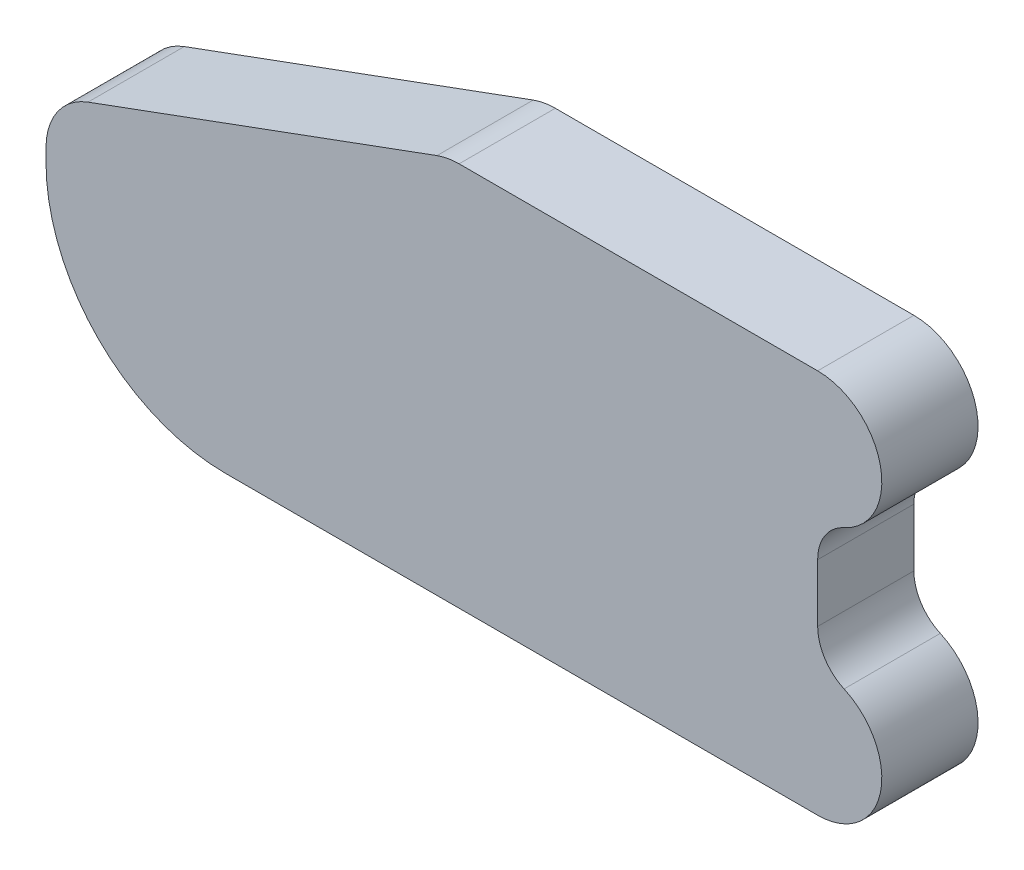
ISO-10303-21;
HEADER;
FILE_DESCRIPTION(('STEP AP214'),'2;1');
FILE_NAME('part.step','',(''),(''),'','','');
FILE_SCHEMA(('AUTOMOTIVE_DESIGN { 1 0 10303 214 1 1 1 1 }'));
ENDSEC;
DATA;
#1=APPLICATION_CONTEXT('core data for automotive mechanical design processes');
#2=APPLICATION_PROTOCOL_DEFINITION('international standard','automotive_design',2000,#1);
#3=PRODUCT_CONTEXT('',#1,'mechanical');
#4=PRODUCT('Part','Part','',(#3));
#5=PRODUCT_RELATED_PRODUCT_CATEGORY('part','',(#4));
#6=PRODUCT_DEFINITION_FORMATION('','',#4);
#7=PRODUCT_DEFINITION_CONTEXT('part definition',#1,'design');
#8=PRODUCT_DEFINITION('design','',#6,#7);
#9=PRODUCT_DEFINITION_SHAPE('','',#8);
#10=(LENGTH_UNIT() NAMED_UNIT(*) SI_UNIT(.MILLI.,.METRE.));
#11=(NAMED_UNIT(*) PLANE_ANGLE_UNIT() SI_UNIT($,.RADIAN.));
#12=(NAMED_UNIT(*) SI_UNIT($,.STERADIAN.) SOLID_ANGLE_UNIT());
#13=UNCERTAINTY_MEASURE_WITH_UNIT(LENGTH_MEASURE(1.E-05),#10,'distance_accuracy_value','');
#14=(GEOMETRIC_REPRESENTATION_CONTEXT(3) GLOBAL_UNCERTAINTY_ASSIGNED_CONTEXT((#13)) GLOBAL_UNIT_ASSIGNED_CONTEXT((#10,
#11,#12)) REPRESENTATION_CONTEXT('',''));
#15=CARTESIAN_POINT('',(0.,0.,0.));
#16=DIRECTION('',(0.,0.,1.));
#17=DIRECTION('',(1.,0.,0.));
#18=AXIS2_PLACEMENT_3D('',#15,#16,#17);
#19=CARTESIAN_POINT('',(-152.,28.,15.));
#20=DIRECTION('',(0.,0.,-1.));
#21=DIRECTION('',(-1.,0.,0.));
#22=AXIS2_PLACEMENT_3D('',#19,#20,#21);
#23=CYLINDRICAL_SURFACE('',#22,28.);
#24=CARTESIAN_POINT('',(-152.,28.,0.));
#25=DIRECTION('',(0.,0.,1.));
#26=DIRECTION('',(-1.,0.,0.));
#27=AXIS2_PLACEMENT_3D('',#24,#25,#26);
#28=CIRCLE('',#27,28.);
#29=CARTESIAN_POINT('',(-180.,28.,0.));
#30=VERTEX_POINT('',#29);
#31=CARTESIAN_POINT('',(-152.,0.,0.));
#32=VERTEX_POINT('',#31);
#33=EDGE_CURVE('E123',#30,#32,#28,.T.);
#34=ORIENTED_EDGE('',*,*,#33,.T.);
#35=DIRECTION('',(0.,0.,-1.));
#36=VECTOR('',#35,1.);
#37=CARTESIAN_POINT('',(-152.,0.,15.));
#38=LINE('',#37,#36);
#39=CARTESIAN_POINT('',(-152.,0.,15.));
#40=VERTEX_POINT('',#39);
#41=EDGE_CURVE('E11',#40,#32,#38,.T.);
#42=ORIENTED_EDGE('',*,*,#41,.F.);
#43=CARTESIAN_POINT('',(-152.,28.,15.));
#44=DIRECTION('',(0.,0.,1.));
#45=DIRECTION('',(-1.,0.,0.));
#46=AXIS2_PLACEMENT_3D('',#43,#44,#45);
#47=CIRCLE('',#46,28.);
#48=CARTESIAN_POINT('',(-180.,28.,15.));
#49=VERTEX_POINT('',#48);
#50=EDGE_CURVE('E158',#49,#40,#47,.T.);
#51=ORIENTED_EDGE('',*,*,#50,.F.);
#52=DIRECTION('',(0.,0.,-1.));
#53=VECTOR('',#52,1.);
#54=CARTESIAN_POINT('',(-180.,28.,15.));
#55=LINE('',#54,#53);
#56=EDGE_CURVE('E136',#49,#30,#55,.T.);
#57=ORIENTED_EDGE('',*,*,#56,.T.);
#58=EDGE_LOOP('',(#34,#42,#51,#57));
#59=FACE_BOUND('',#58,.T.);
#60=ADVANCED_FACE('F31',(#59),#23,.T.);
#61=CARTESIAN_POINT('',(-152.,0.,15.));
#62=DIRECTION('',(0.,1.,0.));
#63=DIRECTION('',(0.,0.,1.));
#64=AXIS2_PLACEMENT_3D('',#61,#62,#63);
#65=PLANE('',#64);
#66=DIRECTION('',(1.,0.,0.));
#67=VECTOR('',#66,1.);
#68=CARTESIAN_POINT('',(-152.,0.,0.));
#69=LINE('',#68,#67);
#70=CARTESIAN_POINT('',(-59.7,0.,0.));
#71=VERTEX_POINT('',#70);
#72=EDGE_CURVE('E119',#32,#71,#69,.T.);
#73=ORIENTED_EDGE('',*,*,#72,.T.);
#74=DIRECTION('',(0.,0.,-1.));
#75=VECTOR('',#74,1.);
#76=CARTESIAN_POINT('',(-59.7,0.,15.));
#77=LINE('',#76,#75);
#78=CARTESIAN_POINT('',(-59.7,0.,15.));
#79=VERTEX_POINT('',#78);
#80=EDGE_CURVE('E38',#79,#71,#77,.T.);
#81=ORIENTED_EDGE('',*,*,#80,.F.);
#82=DIRECTION('',(1.,0.,0.));
#83=VECTOR('',#82,1.);
#84=CARTESIAN_POINT('',(-152.,0.,15.));
#85=LINE('',#84,#83);
#86=EDGE_CURVE('E132',#40,#79,#85,.T.);
#87=ORIENTED_EDGE('',*,*,#86,.F.);
#88=ORIENTED_EDGE('',*,*,#41,.T.);
#89=EDGE_LOOP('',(#73,#81,#87,#88));
#90=FACE_BOUND('',#89,.T.);
#91=ADVANCED_FACE('F131',(#90),#65,.F.);
#92=CARTESIAN_POINT('',(-59.7,10.,15.));
#93=DIRECTION('',(0.,0.,-1.));
#94=DIRECTION('',(-1.,0.,0.));
#95=AXIS2_PLACEMENT_3D('',#92,#93,#94);
#96=CYLINDRICAL_SURFACE('',#95,10.);
#97=CARTESIAN_POINT('',(-59.7,10.,0.));
#98=DIRECTION('',(0.,0.,1.));
#99=DIRECTION('',(1.,0.,0.));
#100=AXIS2_PLACEMENT_3D('',#97,#98,#99);
#101=CIRCLE('',#100,10.);
#102=CARTESIAN_POINT('',(-55.5823529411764,19.1129019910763,0.));
#103=VERTEX_POINT('',#102);
#104=EDGE_CURVE('E125',#71,#103,#101,.T.);
#105=ORIENTED_EDGE('',*,*,#104,.T.);
#106=DIRECTION('',(0.,0.,-1.));
#107=VECTOR('',#106,1.);
#108=CARTESIAN_POINT('',(-55.5823529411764,19.1129019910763,15.));
#109=LINE('',#108,#107);
#110=CARTESIAN_POINT('',(-55.5823529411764,19.1129019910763,15.));
#111=VERTEX_POINT('',#110);
#112=EDGE_CURVE('E204',#111,#103,#109,.T.);
#113=ORIENTED_EDGE('',*,*,#112,.F.);
#114=CARTESIAN_POINT('',(-59.7,10.,15.));
#115=DIRECTION('',(0.,0.,1.));
#116=DIRECTION('',(1.,0.,0.));
#117=AXIS2_PLACEMENT_3D('',#114,#115,#116);
#118=CIRCLE('',#117,10.);
#119=EDGE_CURVE('E161',#79,#111,#118,.T.);
#120=ORIENTED_EDGE('',*,*,#119,.F.);
#121=ORIENTED_EDGE('',*,*,#80,.T.);
#122=EDGE_LOOP('',(#105,#113,#120,#121));
#123=FACE_BOUND('',#122,.T.);
#124=ADVANCED_FACE('F208',(#123),#96,.T.);
#125=CARTESIAN_POINT('',(-52.7,25.4919333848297,15.));
#126=DIRECTION('',(0.,0.,-1.));
#127=DIRECTION('',(-1.,0.,0.));
#128=AXIS2_PLACEMENT_3D('',#125,#126,#127);
#129=CYLINDRICAL_SURFACE('',#128,7.);
#130=CARTESIAN_POINT('',(-52.7,25.4919333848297,0.));
#131=DIRECTION('',(0.,0.,-1.));
#132=DIRECTION('',(-1.,0.,0.));
#133=AXIS2_PLACEMENT_3D('',#130,#131,#132);
#134=CIRCLE('',#133,7.);
#135=CARTESIAN_POINT('',(-59.7,25.4919333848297,0.));
#136=VERTEX_POINT('',#135);
#137=EDGE_CURVE('E140',#103,#136,#134,.T.);
#138=ORIENTED_EDGE('',*,*,#137,.T.);
#139=DIRECTION('',(0.,0.,-1.));
#140=VECTOR('',#139,1.);
#141=CARTESIAN_POINT('',(-59.7,25.4919333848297,15.));
#142=LINE('',#141,#140);
#143=CARTESIAN_POINT('',(-59.7,25.4919333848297,15.));
#144=VERTEX_POINT('',#143);
#145=EDGE_CURVE('E201',#144,#136,#142,.T.);
#146=ORIENTED_EDGE('',*,*,#145,.F.);
#147=CARTESIAN_POINT('',(-52.7,25.4919333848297,15.));
#148=DIRECTION('',(0.,0.,-1.));
#149=DIRECTION('',(-1.,0.,0.));
#150=AXIS2_PLACEMENT_3D('',#147,#148,#149);
#151=CIRCLE('',#150,7.);
#152=EDGE_CURVE('E163',#111,#144,#151,.T.);
#153=ORIENTED_EDGE('',*,*,#152,.F.);
#154=ORIENTED_EDGE('',*,*,#112,.T.);
#155=EDGE_LOOP('',(#138,#146,#153,#154));
#156=FACE_BOUND('',#155,.T.);
#157=ADVANCED_FACE('F216',(#156),#129,.F.);
#158=CARTESIAN_POINT('',(-59.7,34.5080666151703,15.));
#159=DIRECTION('',(-1.,0.,0.));
#160=DIRECTION('',(0.,0.,1.));
#161=AXIS2_PLACEMENT_3D('',#158,#159,#160);
#162=PLANE('',#161);
#163=DIRECTION('',(0.,1.,0.));
#164=VECTOR('',#163,1.);
#165=CARTESIAN_POINT('',(-59.7,34.5080666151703,0.));
#166=LINE('',#165,#164);
#167=CARTESIAN_POINT('',(-59.7,34.5080666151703,0.));
#168=VERTEX_POINT('',#167);
#169=EDGE_CURVE('E142',#136,#168,#166,.T.);
#170=ORIENTED_EDGE('',*,*,#169,.T.);
#171=DIRECTION('',(0.,0.,-1.));
#172=VECTOR('',#171,1.);
#173=CARTESIAN_POINT('',(-59.7,34.5080666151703,15.));
#174=LINE('',#173,#172);
#175=CARTESIAN_POINT('',(-59.7,34.5080666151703,15.));
#176=VERTEX_POINT('',#175);
#177=EDGE_CURVE('E198',#176,#168,#174,.T.);
#178=ORIENTED_EDGE('',*,*,#177,.F.);
#179=DIRECTION('',(0.,1.,0.));
#180=VECTOR('',#179,1.);
#181=CARTESIAN_POINT('',(-59.7,34.5080666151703,15.));
#182=LINE('',#181,#180);
#183=EDGE_CURVE('E165',#144,#176,#182,.T.);
#184=ORIENTED_EDGE('',*,*,#183,.F.);
#185=ORIENTED_EDGE('',*,*,#145,.T.);
#186=EDGE_LOOP('',(#170,#178,#184,#185));
#187=FACE_BOUND('',#186,.T.);
#188=ADVANCED_FACE('F219',(#187),#162,.F.);
#189=CARTESIAN_POINT('',(-52.7,34.5080666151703,15.));
#190=DIRECTION('',(0.,0.,-1.));
#191=DIRECTION('',(-1.,0.,0.));
#192=AXIS2_PLACEMENT_3D('',#189,#190,#191);
#193=CYLINDRICAL_SURFACE('',#192,7.);
#194=CARTESIAN_POINT('',(-52.7,34.5080666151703,0.));
#195=DIRECTION('',(0.,0.,-1.));
#196=DIRECTION('',(-1.,0.,0.));
#197=AXIS2_PLACEMENT_3D('',#194,#195,#196);
#198=CIRCLE('',#197,7.);
#199=CARTESIAN_POINT('',(-55.5823529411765,40.8870980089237,0.));
#200=VERTEX_POINT('',#199);
#201=EDGE_CURVE('E144',#168,#200,#198,.T.);
#202=ORIENTED_EDGE('',*,*,#201,.T.);
#203=DIRECTION('',(0.,0.,-1.));
#204=VECTOR('',#203,1.);
#205=CARTESIAN_POINT('',(-55.5823529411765,40.8870980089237,15.));
#206=LINE('',#205,#204);
#207=CARTESIAN_POINT('',(-55.5823529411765,40.8870980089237,15.));
#208=VERTEX_POINT('',#207);
#209=EDGE_CURVE('E195',#208,#200,#206,.T.);
#210=ORIENTED_EDGE('',*,*,#209,.F.);
#211=CARTESIAN_POINT('',(-52.7,34.5080666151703,15.));
#212=DIRECTION('',(0.,0.,-1.));
#213=DIRECTION('',(-1.,0.,0.));
#214=AXIS2_PLACEMENT_3D('',#211,#212,#213);
#215=CIRCLE('',#214,7.);
#216=EDGE_CURVE('E167',#176,#208,#215,.T.);
#217=ORIENTED_EDGE('',*,*,#216,.F.);
#218=ORIENTED_EDGE('',*,*,#177,.T.);
#219=EDGE_LOOP('',(#202,#210,#217,#218));
#220=FACE_BOUND('',#219,.T.);
#221=ADVANCED_FACE('F224',(#220),#193,.F.);
#222=CARTESIAN_POINT('',(-59.7,50.,15.));
#223=DIRECTION('',(0.,0.,-1.));
#224=DIRECTION('',(-1.,0.,0.));
#225=AXIS2_PLACEMENT_3D('',#222,#223,#224);
#226=CYLINDRICAL_SURFACE('',#225,10.);
#227=CARTESIAN_POINT('',(-59.7,50.,0.));
#228=DIRECTION('',(0.,0.,1.));
#229=DIRECTION('',(1.,0.,0.));
#230=AXIS2_PLACEMENT_3D('',#227,#228,#229);
#231=CIRCLE('',#230,10.);
#232=CARTESIAN_POINT('',(-59.7,60.,0.));
#233=VERTEX_POINT('',#232);
#234=EDGE_CURVE('E146',#200,#233,#231,.T.);
#235=ORIENTED_EDGE('',*,*,#234,.T.);
#236=DIRECTION('',(0.,0.,-1.));
#237=VECTOR('',#236,1.);
#238=CARTESIAN_POINT('',(-59.7,60.,15.));
#239=LINE('',#238,#237);
#240=CARTESIAN_POINT('',(-59.7,60.,15.));
#241=VERTEX_POINT('',#240);
#242=EDGE_CURVE('E192',#241,#233,#239,.T.);
#243=ORIENTED_EDGE('',*,*,#242,.F.);
#244=CARTESIAN_POINT('',(-59.7,50.,15.));
#245=DIRECTION('',(0.,0.,1.));
#246=DIRECTION('',(1.,0.,0.));
#247=AXIS2_PLACEMENT_3D('',#244,#245,#246);
#248=CIRCLE('',#247,10.);
#249=EDGE_CURVE('E169',#208,#241,#248,.T.);
#250=ORIENTED_EDGE('',*,*,#249,.F.);
#251=ORIENTED_EDGE('',*,*,#209,.T.);
#252=EDGE_LOOP('',(#235,#243,#250,#251));
#253=FACE_BOUND('',#252,.T.);
#254=ADVANCED_FACE('F230',(#253),#226,.T.);
#255=CARTESIAN_POINT('',(-115.6,60.,15.));
#256=DIRECTION('',(0.,-1.,0.));
#257=DIRECTION('',(0.,0.,-1.));
#258=AXIS2_PLACEMENT_3D('',#255,#256,#257);
#259=PLANE('',#258);
#260=DIRECTION('',(-1.,0.,0.));
#261=VECTOR('',#260,1.);
#262=CARTESIAN_POINT('',(-115.6,60.,0.));
#263=LINE('',#262,#261);
#264=CARTESIAN_POINT('',(-115.6,60.,0.));
#265=VERTEX_POINT('',#264);
#266=EDGE_CURVE('E148',#233,#265,#263,.T.);
#267=ORIENTED_EDGE('',*,*,#266,.T.);
#268=DIRECTION('',(0.,0.,-1.));
#269=VECTOR('',#268,1.);
#270=CARTESIAN_POINT('',(-115.6,60.,15.));
#271=LINE('',#270,#269);
#272=CARTESIAN_POINT('',(-115.6,60.,15.));
#273=VERTEX_POINT('',#272);
#274=EDGE_CURVE('E189',#273,#265,#271,.T.);
#275=ORIENTED_EDGE('',*,*,#274,.F.);
#276=DIRECTION('',(-1.,0.,0.));
#277=VECTOR('',#276,1.);
#278=CARTESIAN_POINT('',(-115.6,60.,15.));
#279=LINE('',#278,#277);
#280=EDGE_CURVE('E171',#241,#273,#279,.T.);
#281=ORIENTED_EDGE('',*,*,#280,.F.);
#282=ORIENTED_EDGE('',*,*,#242,.T.);
#283=EDGE_LOOP('',(#267,#275,#281,#282));
#284=FACE_BOUND('',#283,.T.);
#285=ADVANCED_FACE('F234',(#284),#259,.F.);
#286=CARTESIAN_POINT('',(-115.6,50.,15.));
#287=DIRECTION('',(0.,0.,-1.));
#288=DIRECTION('',(-1.,0.,0.));
#289=AXIS2_PLACEMENT_3D('',#286,#287,#288);
#290=CYLINDRICAL_SURFACE('',#289,10.);
#291=CARTESIAN_POINT('',(-115.6,50.,0.));
#292=DIRECTION('',(0.,0.,1.));
#293=DIRECTION('',(1.,0.,0.));
#294=AXIS2_PLACEMENT_3D('',#291,#292,#293);
#295=CIRCLE('',#294,10.);
#296=CARTESIAN_POINT('',(-119.047663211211,59.3868854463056,0.));
#297=VERTEX_POINT('',#296);
#298=EDGE_CURVE('E150',#265,#297,#295,.T.);
#299=ORIENTED_EDGE('',*,*,#298,.T.);
#300=DIRECTION('',(0.,0.,-1.));
#301=VECTOR('',#300,1.);
#302=CARTESIAN_POINT('',(-119.047663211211,59.3868854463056,15.));
#303=LINE('',#302,#301);
#304=CARTESIAN_POINT('',(-119.047663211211,59.3868854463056,15.));
#305=VERTEX_POINT('',#304);
#306=EDGE_CURVE('E186',#305,#297,#303,.T.);
#307=ORIENTED_EDGE('',*,*,#306,.F.);
#308=CARTESIAN_POINT('',(-115.6,50.,15.));
#309=DIRECTION('',(0.,0.,1.));
#310=DIRECTION('',(1.,0.,0.));
#311=AXIS2_PLACEMENT_3D('',#308,#309,#310);
#312=CIRCLE('',#311,10.);
#313=EDGE_CURVE('E173',#273,#305,#312,.T.);
#314=ORIENTED_EDGE('',*,*,#313,.F.);
#315=ORIENTED_EDGE('',*,*,#274,.T.);
#316=EDGE_LOOP('',(#299,#307,#314,#315));
#317=FACE_BOUND('',#316,.T.);
#318=ADVANCED_FACE('F239',(#317),#290,.T.);
#319=CARTESIAN_POINT('',(-119.047663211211,59.3868854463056,15.));
#320=DIRECTION('',(0.344766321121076,-0.93868854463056,0.));
#321=DIRECTION('',(0.93868854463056,0.344766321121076,0.));
#322=AXIS2_PLACEMENT_3D('',#319,#320,#321);
#323=PLANE('',#322);
#324=DIRECTION('',(-0.93868854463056,-0.344766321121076,0.));
#325=VECTOR('',#324,1.);
#326=CARTESIAN_POINT('',(-119.047663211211,59.3868854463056,0.));
#327=LINE('',#326,#325);
#328=CARTESIAN_POINT('',(-173.447663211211,39.4065757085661,0.));
#329=VERTEX_POINT('',#328);
#330=EDGE_CURVE('E152',#297,#329,#327,.T.);
#331=ORIENTED_EDGE('',*,*,#330,.T.);
#332=DIRECTION('',(0.,0.,-1.));
#333=VECTOR('',#332,1.);
#334=CARTESIAN_POINT('',(-173.447663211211,39.4065757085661,15.));
#335=LINE('',#334,#333);
#336=CARTESIAN_POINT('',(-173.447663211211,39.4065757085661,15.));
#337=VERTEX_POINT('',#336);
#338=EDGE_CURVE('E183',#337,#329,#335,.T.);
#339=ORIENTED_EDGE('',*,*,#338,.F.);
#340=DIRECTION('',(-0.93868854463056,-0.344766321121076,0.));
#341=VECTOR('',#340,1.);
#342=CARTESIAN_POINT('',(-119.047663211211,59.3868854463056,15.));
#343=LINE('',#342,#341);
#344=EDGE_CURVE('E175',#305,#337,#343,.T.);
#345=ORIENTED_EDGE('',*,*,#344,.F.);
#346=ORIENTED_EDGE('',*,*,#306,.T.);
#347=EDGE_LOOP('',(#331,#339,#345,#346));
#348=FACE_BOUND('',#347,.T.);
#349=ADVANCED_FACE('F243',(#348),#323,.F.);
#350=CARTESIAN_POINT('',(-170.,30.0196902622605,15.));
#351=DIRECTION('',(0.,0.,-1.));
#352=DIRECTION('',(-1.,0.,0.));
#353=AXIS2_PLACEMENT_3D('',#350,#351,#352);
#354=CYLINDRICAL_SURFACE('',#353,10.);
#355=CARTESIAN_POINT('',(-170.,30.0196902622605,0.));
#356=DIRECTION('',(0.,0.,1.));
#357=DIRECTION('',(1.,0.,0.));
#358=AXIS2_PLACEMENT_3D('',#355,#356,#357);
#359=CIRCLE('',#358,10.);
#360=CARTESIAN_POINT('',(-180.,30.0196902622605,0.));
#361=VERTEX_POINT('',#360);
#362=EDGE_CURVE('E154',#329,#361,#359,.T.);
#363=ORIENTED_EDGE('',*,*,#362,.T.);
#364=DIRECTION('',(0.,0.,-1.));
#365=VECTOR('',#364,1.);
#366=CARTESIAN_POINT('',(-180.,30.0196902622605,15.));
#367=LINE('',#366,#365);
#368=CARTESIAN_POINT('',(-180.,30.0196902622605,15.));
#369=VERTEX_POINT('',#368);
#370=EDGE_CURVE('E180',#369,#361,#367,.T.);
#371=ORIENTED_EDGE('',*,*,#370,.F.);
#372=CARTESIAN_POINT('',(-170.,30.0196902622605,15.));
#373=DIRECTION('',(0.,0.,1.));
#374=DIRECTION('',(1.,0.,0.));
#375=AXIS2_PLACEMENT_3D('',#372,#373,#374);
#376=CIRCLE('',#375,10.);
#377=EDGE_CURVE('E50',#337,#369,#376,.T.);
#378=ORIENTED_EDGE('',*,*,#377,.F.);
#379=ORIENTED_EDGE('',*,*,#338,.T.);
#380=EDGE_LOOP('',(#363,#371,#378,#379));
#381=FACE_BOUND('',#380,.T.);
#382=ADVANCED_FACE('F247',(#381),#354,.T.);
#383=CARTESIAN_POINT('',(-180.,30.0196902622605,15.));
#384=DIRECTION('',(1.,0.,0.));
#385=DIRECTION('',(0.,1.,0.));
#386=AXIS2_PLACEMENT_3D('',#383,#384,#385);
#387=PLANE('',#386);
#388=DIRECTION('',(0.,-1.,0.));
#389=VECTOR('',#388,1.);
#390=CARTESIAN_POINT('',(-180.,30.0196902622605,0.));
#391=LINE('',#390,#389);
#392=EDGE_CURVE('E156',#361,#30,#391,.T.);
#393=ORIENTED_EDGE('',*,*,#392,.T.);
#394=ORIENTED_EDGE('',*,*,#56,.F.);
#395=DIRECTION('',(0.,-1.,0.));
#396=VECTOR('',#395,1.);
#397=CARTESIAN_POINT('',(-180.,30.0196902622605,15.));
#398=LINE('',#397,#396);
#399=EDGE_CURVE('E45',#369,#49,#398,.T.);
#400=ORIENTED_EDGE('',*,*,#399,.F.);
#401=ORIENTED_EDGE('',*,*,#370,.T.);
#402=EDGE_LOOP('',(#393,#394,#400,#401));
#403=FACE_BOUND('',#402,.T.);
#404=ADVANCED_FACE('F249',(#403),#387,.F.);
#405=CARTESIAN_POINT('',(-152.,28.,15.));
#406=DIRECTION('',(0.,0.,-1.));
#407=DIRECTION('',(-1.,0.,0.));
#408=AXIS2_PLACEMENT_3D('',#405,#406,#407);
#409=PLANE('',#408);
#410=ORIENTED_EDGE('',*,*,#50,.T.);
#411=ORIENTED_EDGE('',*,*,#86,.T.);
#412=ORIENTED_EDGE('',*,*,#119,.T.);
#413=ORIENTED_EDGE('',*,*,#152,.T.);
#414=ORIENTED_EDGE('',*,*,#183,.T.);
#415=ORIENTED_EDGE('',*,*,#216,.T.);
#416=ORIENTED_EDGE('',*,*,#249,.T.);
#417=ORIENTED_EDGE('',*,*,#280,.T.);
#418=ORIENTED_EDGE('',*,*,#313,.T.);
#419=ORIENTED_EDGE('',*,*,#344,.T.);
#420=ORIENTED_EDGE('',*,*,#377,.T.);
#421=ORIENTED_EDGE('',*,*,#399,.T.);
#422=EDGE_LOOP('',(#410,#411,#412,#413,#414,#415,#416,#417,#418,#419,#420,#421));
#423=FACE_BOUND('',#422,.T.);
#424=ADVANCED_FACE('F211',(#423),#409,.F.);
#425=CARTESIAN_POINT('',(-152.,28.,0.));
#426=DIRECTION('',(0.,0.,-1.));
#427=DIRECTION('',(-1.,0.,0.));
#428=AXIS2_PLACEMENT_3D('',#425,#426,#427);
#429=PLANE('',#428);
#430=ORIENTED_EDGE('',*,*,#33,.F.);
#431=ORIENTED_EDGE('',*,*,#392,.F.);
#432=ORIENTED_EDGE('',*,*,#362,.F.);
#433=ORIENTED_EDGE('',*,*,#330,.F.);
#434=ORIENTED_EDGE('',*,*,#298,.F.);
#435=ORIENTED_EDGE('',*,*,#266,.F.);
#436=ORIENTED_EDGE('',*,*,#234,.F.);
#437=ORIENTED_EDGE('',*,*,#201,.F.);
#438=ORIENTED_EDGE('',*,*,#169,.F.);
#439=ORIENTED_EDGE('',*,*,#137,.F.);
#440=ORIENTED_EDGE('',*,*,#104,.F.);
#441=ORIENTED_EDGE('',*,*,#72,.F.);
#442=EDGE_LOOP('',(#430,#431,#432,#433,#434,#435,#436,#437,#438,#439,#440,#441));
#443=FACE_BOUND('',#442,.T.);
#444=ADVANCED_FACE('F120',(#443),#429,.T.);
#445=CLOSED_SHELL('',(#60,#91,#124,#157,#188,#221,#254,#285,#318,#349,#382,#404,#424,#444));
#446=MANIFOLD_SOLID_BREP('B2',#445);
#447=ADVANCED_BREP_SHAPE_REPRESENTATION('',(#18,#446),#14);
#448=SHAPE_DEFINITION_REPRESENTATION(#9,#447);
ENDSEC;
END-ISO-10303-21;
